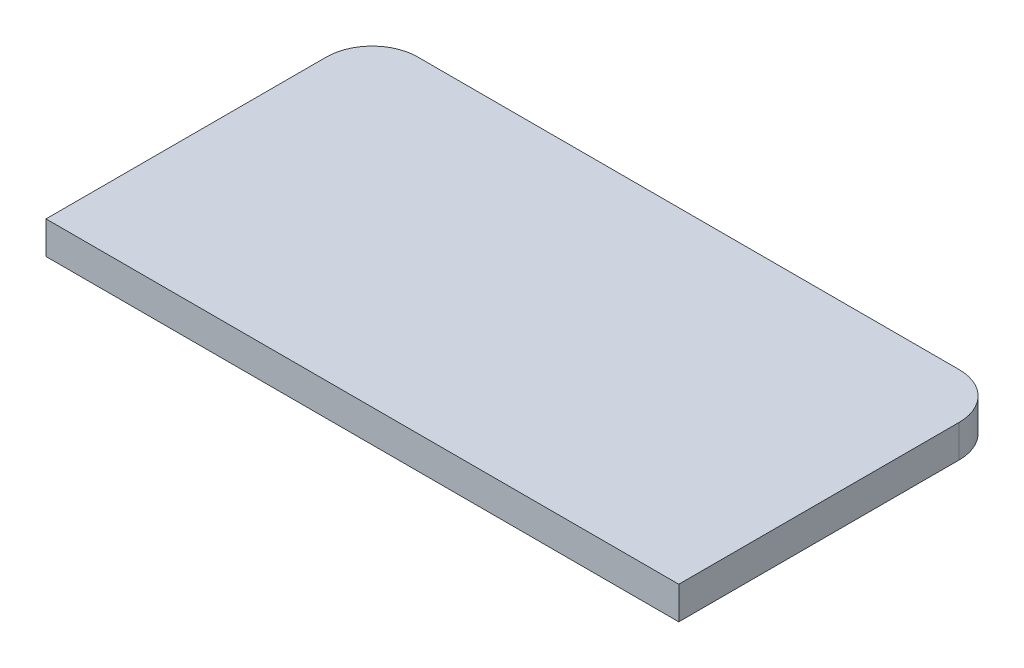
ISO-10303-21;
HEADER;
FILE_DESCRIPTION(('STEP AP214'),'2;1');
FILE_NAME('part.step','',(''),(''),'','','');
FILE_SCHEMA(('AUTOMOTIVE_DESIGN { 1 0 10303 214 1 1 1 1 }'));
ENDSEC;
DATA;
#1=APPLICATION_CONTEXT('core data for automotive mechanical design processes');
#2=APPLICATION_PROTOCOL_DEFINITION('international standard','automotive_design',2000,#1);
#3=PRODUCT_CONTEXT('',#1,'mechanical');
#4=PRODUCT('Part','Part','',(#3));
#5=PRODUCT_RELATED_PRODUCT_CATEGORY('part','',(#4));
#6=PRODUCT_DEFINITION_FORMATION('','',#4);
#7=PRODUCT_DEFINITION_CONTEXT('part definition',#1,'design');
#8=PRODUCT_DEFINITION('design','',#6,#7);
#9=PRODUCT_DEFINITION_SHAPE('','',#8);
#10=(LENGTH_UNIT() NAMED_UNIT(*) SI_UNIT(.MILLI.,.METRE.));
#11=(NAMED_UNIT(*) PLANE_ANGLE_UNIT() SI_UNIT($,.RADIAN.));
#12=(NAMED_UNIT(*) SI_UNIT($,.STERADIAN.) SOLID_ANGLE_UNIT());
#13=UNCERTAINTY_MEASURE_WITH_UNIT(LENGTH_MEASURE(1.E-05),#10,'distance_accuracy_value','');
#14=(GEOMETRIC_REPRESENTATION_CONTEXT(3) GLOBAL_UNCERTAINTY_ASSIGNED_CONTEXT((#13)) GLOBAL_UNIT_ASSIGNED_CONTEXT((#10,
#11,#12)) REPRESENTATION_CONTEXT('',''));
#15=CARTESIAN_POINT('',(0.,0.,0.));
#16=DIRECTION('',(0.,0.,1.));
#17=DIRECTION('',(1.,0.,0.));
#18=AXIS2_PLACEMENT_3D('',#15,#16,#17);
#19=CARTESIAN_POINT('',(26.3621774,3.175,0.));
#20=DIRECTION('',(0.,-1.,0.));
#21=DIRECTION('',(0.,0.,-1.));
#22=AXIS2_PLACEMENT_3D('',#19,#20,#21);
#23=CYLINDRICAL_SURFACE('',#22,4.445);
#24=CARTESIAN_POINT('',(26.3621774,0.,0.));
#25=DIRECTION('',(0.,1.,0.));
#26=DIRECTION('',(0.,0.,-1.));
#27=AXIS2_PLACEMENT_3D('',#24,#25,#26);
#28=CIRCLE('',#27,4.445);
#29=CARTESIAN_POINT('',(30.8071774,0.,0.));
#30=VERTEX_POINT('',#29);
#31=CARTESIAN_POINT('',(26.3621774,0.,-4.44500000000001));
#32=VERTEX_POINT('',#31);
#33=EDGE_CURVE('E143',#30,#32,#28,.T.);
#34=ORIENTED_EDGE('',*,*,#33,.T.);
#35=DIRECTION('',(0.,-1.,0.));
#36=VECTOR('',#35,1.);
#37=CARTESIAN_POINT('',(26.3621774,3.175,-4.44500000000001));
#38=LINE('',#37,#36);
#39=CARTESIAN_POINT('',(26.3621774,3.175,-4.44500000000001));
#40=VERTEX_POINT('',#39);
#41=EDGE_CURVE('E11',#40,#32,#38,.T.);
#42=ORIENTED_EDGE('',*,*,#41,.F.);
#43=CARTESIAN_POINT('',(26.3621774,3.175,0.));
#44=DIRECTION('',(0.,1.,0.));
#45=DIRECTION('',(0.,0.,-1.));
#46=AXIS2_PLACEMENT_3D('',#43,#44,#45);
#47=CIRCLE('',#46,4.445);
#48=CARTESIAN_POINT('',(30.8071774,3.175,0.));
#49=VERTEX_POINT('',#48);
#50=EDGE_CURVE('E158',#49,#40,#47,.T.);
#51=ORIENTED_EDGE('',*,*,#50,.F.);
#52=DIRECTION('',(0.,-1.,0.));
#53=VECTOR('',#52,1.);
#54=CARTESIAN_POINT('',(30.8071774,3.175,0.));
#55=LINE('',#54,#53);
#56=EDGE_CURVE('E139',#49,#30,#55,.T.);
#57=ORIENTED_EDGE('',*,*,#56,.T.);
#58=EDGE_LOOP('',(#34,#42,#51,#57));
#59=FACE_BOUND('',#58,.T.);
#60=ADVANCED_FACE('F41',(#59),#23,.T.);
#61=CARTESIAN_POINT('',(-26.3621774,3.175,-4.44500000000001));
#62=DIRECTION('',(0.,0.,1.));
#63=DIRECTION('',(1.,0.,0.));
#64=AXIS2_PLACEMENT_3D('',#61,#62,#63);
#65=PLANE('',#64);
#66=DIRECTION('',(-1.,0.,0.));
#67=VECTOR('',#66,1.);
#68=CARTESIAN_POINT('',(-26.3621774,0.,-4.44500000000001));
#69=LINE('',#68,#67);
#70=CARTESIAN_POINT('',(-26.3621774,0.,-4.44500000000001));
#71=VERTEX_POINT('',#70);
#72=EDGE_CURVE('E147',#32,#71,#69,.T.);
#73=ORIENTED_EDGE('',*,*,#72,.T.);
#74=DIRECTION('',(0.,-1.,0.));
#75=VECTOR('',#74,1.);
#76=CARTESIAN_POINT('',(-26.3621774,3.175,-4.44500000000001));
#77=LINE('',#76,#75);
#78=CARTESIAN_POINT('',(-26.3621774,3.175,-4.44500000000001));
#79=VERTEX_POINT('',#78);
#80=EDGE_CURVE('E50',#79,#71,#77,.T.);
#81=ORIENTED_EDGE('',*,*,#80,.F.);
#82=DIRECTION('',(-1.,0.,0.));
#83=VECTOR('',#82,1.);
#84=CARTESIAN_POINT('',(-26.3621774,3.175,-4.44500000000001));
#85=LINE('',#84,#83);
#86=EDGE_CURVE('E105',#40,#79,#85,.T.);
#87=ORIENTED_EDGE('',*,*,#86,.F.);
#88=ORIENTED_EDGE('',*,*,#41,.T.);
#89=EDGE_LOOP('',(#73,#81,#87,#88));
#90=FACE_BOUND('',#89,.T.);
#91=ADVANCED_FACE('F187',(#90),#65,.F.);
#92=CARTESIAN_POINT('',(-26.3621774,3.175,0.));
#93=DIRECTION('',(0.,-1.,0.));
#94=DIRECTION('',(0.,0.,-1.));
#95=AXIS2_PLACEMENT_3D('',#92,#93,#94);
#96=CYLINDRICAL_SURFACE('',#95,4.445);
#97=CARTESIAN_POINT('',(-26.3621774,0.,0.));
#98=DIRECTION('',(0.,1.,0.));
#99=DIRECTION('',(0.,0.,1.));
#100=AXIS2_PLACEMENT_3D('',#97,#98,#99);
#101=CIRCLE('',#100,4.445);
#102=CARTESIAN_POINT('',(-30.8071774,0.,0.));
#103=VERTEX_POINT('',#102);
#104=EDGE_CURVE('E150',#71,#103,#101,.T.);
#105=ORIENTED_EDGE('',*,*,#104,.T.);
#106=DIRECTION('',(0.,-1.,0.));
#107=VECTOR('',#106,1.);
#108=CARTESIAN_POINT('',(-30.8071774,3.175,0.));
#109=LINE('',#108,#107);
#110=CARTESIAN_POINT('',(-30.8071774,3.175,0.));
#111=VERTEX_POINT('',#110);
#112=EDGE_CURVE('E131',#111,#103,#109,.T.);
#113=ORIENTED_EDGE('',*,*,#112,.F.);
#114=CARTESIAN_POINT('',(-26.3621774,3.175,0.));
#115=DIRECTION('',(0.,1.,0.));
#116=DIRECTION('',(0.,0.,1.));
#117=AXIS2_PLACEMENT_3D('',#114,#115,#116);
#118=CIRCLE('',#117,4.445);
#119=EDGE_CURVE('E120',#79,#111,#118,.T.);
#120=ORIENTED_EDGE('',*,*,#119,.F.);
#121=ORIENTED_EDGE('',*,*,#80,.T.);
#122=EDGE_LOOP('',(#105,#113,#120,#121));
#123=FACE_BOUND('',#122,.T.);
#124=ADVANCED_FACE('F169',(#123),#96,.T.);
#125=CARTESIAN_POINT('',(-30.8071774,3.175,0.));
#126=DIRECTION('',(1.,0.,0.));
#127=DIRECTION('',(0.,0.,-1.));
#128=AXIS2_PLACEMENT_3D('',#125,#126,#127);
#129=PLANE('',#128);
#130=DIRECTION('',(0.,0.,1.));
#131=VECTOR('',#130,1.);
#132=CARTESIAN_POINT('',(-30.8071774,0.,0.));
#133=LINE('',#132,#131);
#134=CARTESIAN_POINT('',(-30.8071774,0.,27.305));
#135=VERTEX_POINT('',#134);
#136=EDGE_CURVE('E129',#103,#135,#133,.T.);
#137=ORIENTED_EDGE('',*,*,#136,.T.);
#138=DIRECTION('',(0.,-1.,0.));
#139=VECTOR('',#138,1.);
#140=CARTESIAN_POINT('',(-30.8071774,3.175,27.305));
#141=LINE('',#140,#139);
#142=CARTESIAN_POINT('',(-30.8071774,3.175,27.305));
#143=VERTEX_POINT('',#142);
#144=EDGE_CURVE('E126',#143,#135,#141,.T.);
#145=ORIENTED_EDGE('',*,*,#144,.F.);
#146=DIRECTION('',(0.,0.,1.));
#147=VECTOR('',#146,1.);
#148=CARTESIAN_POINT('',(-30.8071774,3.175,0.));
#149=LINE('',#148,#147);
#150=EDGE_CURVE('E114',#111,#143,#149,.T.);
#151=ORIENTED_EDGE('',*,*,#150,.F.);
#152=ORIENTED_EDGE('',*,*,#112,.T.);
#153=EDGE_LOOP('',(#137,#145,#151,#152));
#154=FACE_BOUND('',#153,.T.);
#155=ADVANCED_FACE('F127',(#154),#129,.F.);
#156=CARTESIAN_POINT('',(30.8071774,3.175,27.305));
#157=DIRECTION('',(0.,0.,-1.));
#158=DIRECTION('',(-1.,0.,0.));
#159=AXIS2_PLACEMENT_3D('',#156,#157,#158);
#160=PLANE('',#159);
#161=DIRECTION('',(1.,0.,0.));
#162=VECTOR('',#161,1.);
#163=CARTESIAN_POINT('',(30.8071774,0.,27.305));
#164=LINE('',#163,#162);
#165=CARTESIAN_POINT('',(30.8071774,0.,27.305));
#166=VERTEX_POINT('',#165);
#167=EDGE_CURVE('E90',#135,#166,#164,.T.);
#168=ORIENTED_EDGE('',*,*,#167,.T.);
#169=DIRECTION('',(0.,-1.,0.));
#170=VECTOR('',#169,1.);
#171=CARTESIAN_POINT('',(30.8071774,3.175,27.305));
#172=LINE('',#171,#170);
#173=CARTESIAN_POINT('',(30.8071774,3.175,27.305));
#174=VERTEX_POINT('',#173);
#175=EDGE_CURVE('E132',#174,#166,#172,.T.);
#176=ORIENTED_EDGE('',*,*,#175,.F.);
#177=DIRECTION('',(1.,0.,0.));
#178=VECTOR('',#177,1.);
#179=CARTESIAN_POINT('',(30.8071774,3.175,27.305));
#180=LINE('',#179,#178);
#181=EDGE_CURVE('E118',#143,#174,#180,.T.);
#182=ORIENTED_EDGE('',*,*,#181,.F.);
#183=ORIENTED_EDGE('',*,*,#144,.T.);
#184=EDGE_LOOP('',(#168,#176,#182,#183));
#185=FACE_BOUND('',#184,.T.);
#186=ADVANCED_FACE('F134',(#185),#160,.F.);
#187=CARTESIAN_POINT('',(30.8071774,3.175,0.));
#188=DIRECTION('',(-1.,0.,0.));
#189=DIRECTION('',(0.,0.,1.));
#190=AXIS2_PLACEMENT_3D('',#187,#188,#189);
#191=PLANE('',#190);
#192=DIRECTION('',(0.,0.,-1.));
#193=VECTOR('',#192,1.);
#194=CARTESIAN_POINT('',(30.8071774,0.,0.));
#195=LINE('',#194,#193);
#196=EDGE_CURVE('E96',#166,#30,#195,.T.);
#197=ORIENTED_EDGE('',*,*,#196,.T.);
#198=ORIENTED_EDGE('',*,*,#56,.F.);
#199=DIRECTION('',(0.,0.,-1.));
#200=VECTOR('',#199,1.);
#201=CARTESIAN_POINT('',(30.8071774,3.175,0.));
#202=LINE('',#201,#200);
#203=EDGE_CURVE('E61',#174,#49,#202,.T.);
#204=ORIENTED_EDGE('',*,*,#203,.F.);
#205=ORIENTED_EDGE('',*,*,#175,.T.);
#206=EDGE_LOOP('',(#197,#198,#204,#205));
#207=FACE_BOUND('',#206,.T.);
#208=ADVANCED_FACE('F176',(#207),#191,.F.);
#209=CARTESIAN_POINT('',(26.3621774,3.175,0.));
#210=DIRECTION('',(0.,-1.,0.));
#211=DIRECTION('',(0.,0.,-1.));
#212=AXIS2_PLACEMENT_3D('',#209,#210,#211);
#213=PLANE('',#212);
#214=ORIENTED_EDGE('',*,*,#50,.T.);
#215=ORIENTED_EDGE('',*,*,#86,.T.);
#216=ORIENTED_EDGE('',*,*,#119,.T.);
#217=ORIENTED_EDGE('',*,*,#150,.T.);
#218=ORIENTED_EDGE('',*,*,#181,.T.);
#219=ORIENTED_EDGE('',*,*,#203,.T.);
#220=EDGE_LOOP('',(#214,#215,#216,#217,#218,#219));
#221=FACE_BOUND('',#220,.T.);
#222=ADVANCED_FACE('F116',(#221),#213,.F.);
#223=CARTESIAN_POINT('',(26.3621774,0.,0.));
#224=DIRECTION('',(0.,-1.,0.));
#225=DIRECTION('',(0.,0.,-1.));
#226=AXIS2_PLACEMENT_3D('',#223,#224,#225);
#227=PLANE('',#226);
#228=ORIENTED_EDGE('',*,*,#33,.F.);
#229=ORIENTED_EDGE('',*,*,#196,.F.);
#230=ORIENTED_EDGE('',*,*,#167,.F.);
#231=ORIENTED_EDGE('',*,*,#136,.F.);
#232=ORIENTED_EDGE('',*,*,#104,.F.);
#233=ORIENTED_EDGE('',*,*,#72,.F.);
#234=EDGE_LOOP('',(#228,#229,#230,#231,#232,#233));
#235=FACE_BOUND('',#234,.T.);
#236=ADVANCED_FACE('F172',(#235),#227,.T.);
#237=CLOSED_SHELL('',(#60,#91,#124,#155,#186,#208,#222,#236));
#238=MANIFOLD_SOLID_BREP('B2',#237);
#239=ADVANCED_BREP_SHAPE_REPRESENTATION('',(#18,#238),#14);
#240=SHAPE_DEFINITION_REPRESENTATION(#9,#239);
ENDSEC;
END-ISO-10303-21;
